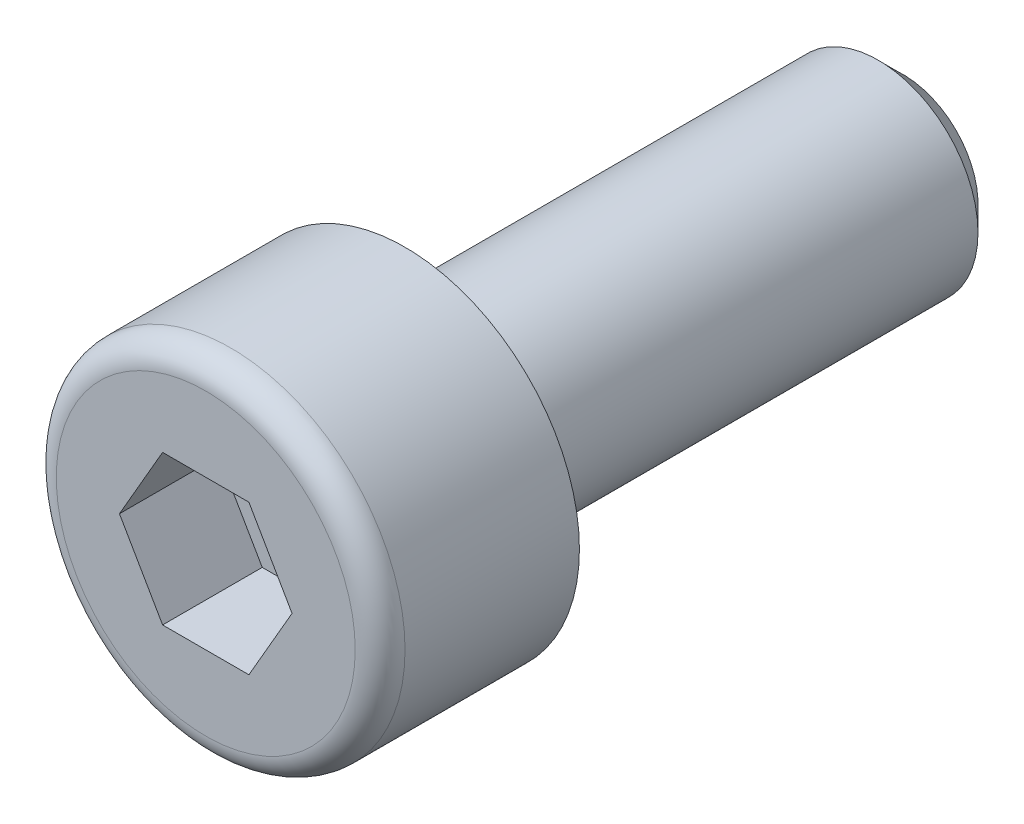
ISO-10303-21;
HEADER;
FILE_DESCRIPTION(('STEP AP214'),'2;1');
FILE_NAME('part.step','',(''),(''),'','','');
FILE_SCHEMA(('AUTOMOTIVE_DESIGN { 1 0 10303 214 1 1 1 1 }'));
ENDSEC;
DATA;
#1=APPLICATION_CONTEXT('core data for automotive mechanical design processes');
#2=APPLICATION_PROTOCOL_DEFINITION('international standard','automotive_design',2000,#1);
#3=PRODUCT_CONTEXT('',#1,'mechanical');
#4=PRODUCT('Part','Part','',(#3));
#5=PRODUCT_RELATED_PRODUCT_CATEGORY('part','',(#4));
#6=PRODUCT_DEFINITION_FORMATION('','',#4);
#7=PRODUCT_DEFINITION_CONTEXT('part definition',#1,'design');
#8=PRODUCT_DEFINITION('design','',#6,#7);
#9=PRODUCT_DEFINITION_SHAPE('','',#8);
#10=(LENGTH_UNIT() NAMED_UNIT(*) SI_UNIT(.MILLI.,.METRE.));
#11=(NAMED_UNIT(*) PLANE_ANGLE_UNIT() SI_UNIT($,.RADIAN.));
#12=(NAMED_UNIT(*) SI_UNIT($,.STERADIAN.) SOLID_ANGLE_UNIT());
#13=UNCERTAINTY_MEASURE_WITH_UNIT(LENGTH_MEASURE(1.E-05),#10,'distance_accuracy_value','');
#14=(GEOMETRIC_REPRESENTATION_CONTEXT(3) GLOBAL_UNCERTAINTY_ASSIGNED_CONTEXT((#13)) GLOBAL_UNIT_ASSIGNED_CONTEXT((#10,
#11,#12)) REPRESENTATION_CONTEXT('',''));
#15=CARTESIAN_POINT('',(0.,0.,0.));
#16=DIRECTION('',(0.,0.,1.));
#17=DIRECTION('',(1.,0.,0.));
#18=AXIS2_PLACEMENT_3D('',#15,#16,#17);
#19=CARTESIAN_POINT('',(0.,0.,0.));
#20=DIRECTION('',(0.,0.,1.));
#21=DIRECTION('',(1.,0.,0.));
#22=AXIS2_PLACEMENT_3D('',#19,#20,#21);
#23=PLANE('',#22);
#24=CARTESIAN_POINT('',(0.,0.,0.));
#25=DIRECTION('',(0.,0.,1.));
#26=DIRECTION('',(1.,0.,0.));
#27=AXIS2_PLACEMENT_3D('',#24,#25,#26);
#28=CIRCLE('',#27,3.5);
#29=CARTESIAN_POINT('',(3.5,0.,0.));
#30=VERTEX_POINT('',#29);
#31=EDGE_CURVE('E135',#30,#30,#28,.T.);
#32=ORIENTED_EDGE('',*,*,#31,.F.);
#33=EDGE_LOOP('',(#32));
#34=FACE_BOUND('',#33,.T.);
#35=CARTESIAN_POINT('',(0.,0.,0.));
#36=DIRECTION('',(0.,0.,1.));
#37=DIRECTION('',(1.,0.,0.));
#38=AXIS2_PLACEMENT_3D('',#35,#36,#37);
#39=CIRCLE('',#38,2.);
#40=CARTESIAN_POINT('',(2.,0.,0.));
#41=VERTEX_POINT('',#40);
#42=EDGE_CURVE('E144',#41,#41,#39,.F.);
#43=ORIENTED_EDGE('',*,*,#42,.F.);
#44=EDGE_LOOP('',(#43));
#45=FACE_BOUND('',#44,.T.);
#46=ADVANCED_FACE('F33',(#34,#45),#23,.F.);
#47=CARTESIAN_POINT('',(0.,0.,4.));
#48=DIRECTION('',(0.,0.,-1.));
#49=DIRECTION('',(-1.,0.,0.));
#50=AXIS2_PLACEMENT_3D('',#47,#48,#49);
#51=CYLINDRICAL_SURFACE('',#50,3.5);
#52=CARTESIAN_POINT('',(0.,0.,3.5));
#53=DIRECTION('',(0.,0.,1.));
#54=DIRECTION('',(1.,0.,0.));
#55=AXIS2_PLACEMENT_3D('',#52,#53,#54);
#56=CIRCLE('',#55,3.5);
#57=CARTESIAN_POINT('',(3.5,0.,3.5));
#58=VERTEX_POINT('',#57);
#59=EDGE_CURVE('E150',#58,#58,#56,.F.);
#60=ORIENTED_EDGE('',*,*,#59,.T.);
#61=EDGE_LOOP('',(#60));
#62=FACE_BOUND('',#61,.T.);
#63=ORIENTED_EDGE('',*,*,#31,.T.);
#64=EDGE_LOOP('',(#63));
#65=FACE_BOUND('',#64,.T.);
#66=ADVANCED_FACE('F35',(#62,#65),#51,.T.);
#67=CARTESIAN_POINT('',(0.,0.,4.));
#68=DIRECTION('',(0.,0.,1.));
#69=DIRECTION('',(1.,0.,0.));
#70=AXIS2_PLACEMENT_3D('',#67,#68,#69);
#71=PLANE('',#70);
#72=CARTESIAN_POINT('',(0.,0.,4.));
#73=DIRECTION('',(0.,0.,1.));
#74=DIRECTION('',(1.,0.,0.));
#75=AXIS2_PLACEMENT_3D('',#72,#73,#74);
#76=CIRCLE('',#75,3.);
#77=CARTESIAN_POINT('',(3.,0.,4.));
#78=VERTEX_POINT('',#77);
#79=EDGE_CURVE('E147',#78,#78,#76,.T.);
#80=ORIENTED_EDGE('',*,*,#79,.T.);
#81=EDGE_LOOP('',(#80));
#82=FACE_BOUND('',#81,.T.);
#83=DIRECTION('',(0.500000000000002,0.866025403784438,0.));
#84=VECTOR('',#83,1.);
#85=CARTESIAN_POINT('',(0.866025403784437,-1.5,4.));
#86=LINE('',#85,#84);
#87=CARTESIAN_POINT('',(0.866025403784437,-1.5,4.));
#88=VERTEX_POINT('',#87);
#89=CARTESIAN_POINT('',(1.73205080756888,0.,4.));
#90=VERTEX_POINT('',#89);
#91=EDGE_CURVE('E48',#88,#90,#86,.T.);
#92=ORIENTED_EDGE('',*,*,#91,.F.);
#93=DIRECTION('',(1.,0.,0.));
#94=VECTOR('',#93,1.);
#95=CARTESIAN_POINT('',(-0.866025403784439,-1.5,4.));
#96=LINE('',#95,#94);
#97=CARTESIAN_POINT('',(-0.866025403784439,-1.5,4.));
#98=VERTEX_POINT('',#97);
#99=EDGE_CURVE('E117',#98,#88,#96,.T.);
#100=ORIENTED_EDGE('',*,*,#99,.F.);
#101=DIRECTION('',(0.500000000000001,-0.866025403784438,0.));
#102=VECTOR('',#101,1.);
#103=CARTESIAN_POINT('',(-1.73205080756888,0.,4.));
#104=LINE('',#103,#102);
#105=CARTESIAN_POINT('',(-1.73205080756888,0.,4.));
#106=VERTEX_POINT('',#105);
#107=EDGE_CURVE('E111',#106,#98,#104,.T.);
#108=ORIENTED_EDGE('',*,*,#107,.F.);
#109=DIRECTION('',(-0.500000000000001,-0.866025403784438,0.));
#110=VECTOR('',#109,1.);
#111=CARTESIAN_POINT('',(-0.866025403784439,1.5,4.));
#112=LINE('',#111,#110);
#113=CARTESIAN_POINT('',(-0.866025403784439,1.5,4.));
#114=VERTEX_POINT('',#113);
#115=EDGE_CURVE('E109',#114,#106,#112,.T.);
#116=ORIENTED_EDGE('',*,*,#115,.F.);
#117=DIRECTION('',(-1.,0.,0.));
#118=VECTOR('',#117,1.);
#119=CARTESIAN_POINT('',(0.866025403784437,1.5,4.));
#120=LINE('',#119,#118);
#121=CARTESIAN_POINT('',(0.866025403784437,1.5,4.));
#122=VERTEX_POINT('',#121);
#123=EDGE_CURVE('E91',#122,#114,#120,.T.);
#124=ORIENTED_EDGE('',*,*,#123,.F.);
#125=DIRECTION('',(-0.500000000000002,0.866025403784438,0.));
#126=VECTOR('',#125,1.);
#127=CARTESIAN_POINT('',(1.73205080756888,0.,4.));
#128=LINE('',#127,#126);
#129=EDGE_CURVE('E102',#90,#122,#128,.T.);
#130=ORIENTED_EDGE('',*,*,#129,.F.);
#131=EDGE_LOOP('',(#92,#100,#108,#116,#124,#130));
#132=FACE_BOUND('',#131,.T.);
#133=ADVANCED_FACE('F106',(#82,#132),#71,.T.);
#134=CARTESIAN_POINT('',(0.,0.,-10.));
#135=DIRECTION('',(0.,0.,1.));
#136=DIRECTION('',(1.,0.,0.));
#137=AXIS2_PLACEMENT_3D('',#134,#135,#136);
#138=CYLINDRICAL_SURFACE('',#137,2.);
#139=CARTESIAN_POINT('',(0.,0.,-9.5));
#140=DIRECTION('',(0.,0.,-1.));
#141=DIRECTION('',(-1.,0.,0.));
#142=AXIS2_PLACEMENT_3D('',#139,#140,#141);
#143=CIRCLE('',#142,2.);
#144=CARTESIAN_POINT('',(-2.,0.,-9.5));
#145=VERTEX_POINT('',#144);
#146=EDGE_CURVE('E11',#145,#145,#143,.F.);
#147=ORIENTED_EDGE('',*,*,#146,.T.);
#148=EDGE_LOOP('',(#147));
#149=FACE_BOUND('',#148,.T.);
#150=ORIENTED_EDGE('',*,*,#42,.T.);
#151=EDGE_LOOP('',(#150));
#152=FACE_BOUND('',#151,.T.);
#153=ADVANCED_FACE('F179',(#149,#152),#138,.T.);
#154=CARTESIAN_POINT('',(0.,0.,-10.));
#155=DIRECTION('',(0.,0.,-1.));
#156=DIRECTION('',(-1.,0.,0.));
#157=AXIS2_PLACEMENT_3D('',#154,#155,#156);
#158=PLANE('',#157);
#159=CARTESIAN_POINT('',(0.,0.,-10.));
#160=DIRECTION('',(0.,0.,-1.));
#161=DIRECTION('',(-1.,0.,0.));
#162=AXIS2_PLACEMENT_3D('',#159,#160,#161);
#163=CIRCLE('',#162,1.49999999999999);
#164=CARTESIAN_POINT('',(-1.49999999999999,0.,-10.));
#165=VERTEX_POINT('',#164);
#166=EDGE_CURVE('E41',#165,#165,#163,.T.);
#167=ORIENTED_EDGE('',*,*,#166,.T.);
#168=EDGE_LOOP('',(#167));
#169=FACE_BOUND('',#168,.T.);
#170=ADVANCED_FACE('F155',(#169),#158,.T.);
#171=CARTESIAN_POINT('',(0.866025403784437,-1.5,2.));
#172=DIRECTION('',(0.866025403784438,-0.500000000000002,0.));
#173=DIRECTION('',(0.500000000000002,0.866025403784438,0.));
#174=AXIS2_PLACEMENT_3D('',#171,#172,#173);
#175=PLANE('',#174);
#176=ORIENTED_EDGE('',*,*,#91,.T.);
#177=DIRECTION('',(0.,0.,1.));
#178=VECTOR('',#177,1.);
#179=CARTESIAN_POINT('',(1.73205080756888,0.,2.));
#180=LINE('',#179,#178);
#181=CARTESIAN_POINT('',(1.73205080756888,0.,2.));
#182=VERTEX_POINT('',#181);
#183=EDGE_CURVE('E99',#182,#90,#180,.T.);
#184=ORIENTED_EDGE('',*,*,#183,.F.);
#185=DIRECTION('',(0.500000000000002,0.866025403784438,0.));
#186=VECTOR('',#185,1.);
#187=CARTESIAN_POINT('',(0.866025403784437,-1.5,2.));
#188=LINE('',#187,#186);
#189=CARTESIAN_POINT('',(0.866025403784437,-1.5,2.));
#190=VERTEX_POINT('',#189);
#191=EDGE_CURVE('E119',#190,#182,#188,.T.);
#192=ORIENTED_EDGE('',*,*,#191,.F.);
#193=DIRECTION('',(0.,0.,1.));
#194=VECTOR('',#193,1.);
#195=CARTESIAN_POINT('',(0.866025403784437,-1.5,2.));
#196=LINE('',#195,#194);
#197=EDGE_CURVE('E55',#190,#88,#196,.T.);
#198=ORIENTED_EDGE('',*,*,#197,.T.);
#199=EDGE_LOOP('',(#176,#184,#192,#198));
#200=FACE_BOUND('',#199,.T.);
#201=ADVANCED_FACE('F192',(#200),#175,.F.);
#202=CARTESIAN_POINT('',(-0.866025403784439,-1.5,2.));
#203=DIRECTION('',(0.,-1.,0.));
#204=DIRECTION('',(1.,0.,0.));
#205=AXIS2_PLACEMENT_3D('',#202,#203,#204);
#206=PLANE('',#205);
#207=ORIENTED_EDGE('',*,*,#99,.T.);
#208=ORIENTED_EDGE('',*,*,#197,.F.);
#209=DIRECTION('',(1.,0.,0.));
#210=VECTOR('',#209,1.);
#211=CARTESIAN_POINT('',(-0.866025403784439,-1.5,2.));
#212=LINE('',#211,#210);
#213=CARTESIAN_POINT('',(-0.866025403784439,-1.5,2.));
#214=VERTEX_POINT('',#213);
#215=EDGE_CURVE('E131',#214,#190,#212,.T.);
#216=ORIENTED_EDGE('',*,*,#215,.F.);
#217=DIRECTION('',(0.,0.,1.));
#218=VECTOR('',#217,1.);
#219=CARTESIAN_POINT('',(-0.866025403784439,-1.5,2.));
#220=LINE('',#219,#218);
#221=EDGE_CURVE('E136',#214,#98,#220,.T.);
#222=ORIENTED_EDGE('',*,*,#221,.T.);
#223=EDGE_LOOP('',(#207,#208,#216,#222));
#224=FACE_BOUND('',#223,.T.);
#225=ADVANCED_FACE('F198',(#224),#206,.F.);
#226=CARTESIAN_POINT('',(-1.73205080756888,0.,2.));
#227=DIRECTION('',(-0.866025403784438,-0.500000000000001,0.));
#228=DIRECTION('',(0.500000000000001,-0.866025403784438,0.));
#229=AXIS2_PLACEMENT_3D('',#226,#227,#228);
#230=PLANE('',#229);
#231=ORIENTED_EDGE('',*,*,#107,.T.);
#232=ORIENTED_EDGE('',*,*,#221,.F.);
#233=DIRECTION('',(0.500000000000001,-0.866025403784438,0.));
#234=VECTOR('',#233,1.);
#235=CARTESIAN_POINT('',(-1.73205080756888,0.,2.));
#236=LINE('',#235,#234);
#237=CARTESIAN_POINT('',(-1.73205080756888,0.,2.));
#238=VERTEX_POINT('',#237);
#239=EDGE_CURVE('E128',#238,#214,#236,.T.);
#240=ORIENTED_EDGE('',*,*,#239,.F.);
#241=DIRECTION('',(0.,0.,1.));
#242=VECTOR('',#241,1.);
#243=CARTESIAN_POINT('',(-1.73205080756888,0.,2.));
#244=LINE('',#243,#242);
#245=EDGE_CURVE('E138',#238,#106,#244,.T.);
#246=ORIENTED_EDGE('',*,*,#245,.T.);
#247=EDGE_LOOP('',(#231,#232,#240,#246));
#248=FACE_BOUND('',#247,.T.);
#249=ADVANCED_FACE('F208',(#248),#230,.F.);
#250=CARTESIAN_POINT('',(-0.866025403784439,1.5,2.));
#251=DIRECTION('',(-0.866025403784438,0.500000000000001,0.));
#252=DIRECTION('',(-0.500000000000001,-0.866025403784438,0.));
#253=AXIS2_PLACEMENT_3D('',#250,#251,#252);
#254=PLANE('',#253);
#255=ORIENTED_EDGE('',*,*,#115,.T.);
#256=ORIENTED_EDGE('',*,*,#245,.F.);
#257=DIRECTION('',(-0.500000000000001,-0.866025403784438,0.));
#258=VECTOR('',#257,1.);
#259=CARTESIAN_POINT('',(-0.866025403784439,1.5,2.));
#260=LINE('',#259,#258);
#261=CARTESIAN_POINT('',(-0.866025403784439,1.5,2.));
#262=VERTEX_POINT('',#261);
#263=EDGE_CURVE('E125',#262,#238,#260,.T.);
#264=ORIENTED_EDGE('',*,*,#263,.F.);
#265=DIRECTION('',(0.,0.,1.));
#266=VECTOR('',#265,1.);
#267=CARTESIAN_POINT('',(-0.866025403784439,1.5,2.));
#268=LINE('',#267,#266);
#269=EDGE_CURVE('E98',#262,#114,#268,.T.);
#270=ORIENTED_EDGE('',*,*,#269,.T.);
#271=EDGE_LOOP('',(#255,#256,#264,#270));
#272=FACE_BOUND('',#271,.T.);
#273=ADVANCED_FACE('F205',(#272),#254,.F.);
#274=CARTESIAN_POINT('',(0.866025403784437,1.5,2.));
#275=DIRECTION('',(0.,1.,0.));
#276=DIRECTION('',(-1.,0.,0.));
#277=AXIS2_PLACEMENT_3D('',#274,#275,#276);
#278=PLANE('',#277);
#279=ORIENTED_EDGE('',*,*,#123,.T.);
#280=ORIENTED_EDGE('',*,*,#269,.F.);
#281=DIRECTION('',(-1.,0.,0.));
#282=VECTOR('',#281,1.);
#283=CARTESIAN_POINT('',(0.866025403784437,1.5,2.));
#284=LINE('',#283,#282);
#285=CARTESIAN_POINT('',(0.866025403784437,1.5,2.));
#286=VERTEX_POINT('',#285);
#287=EDGE_CURVE('E94',#286,#262,#284,.T.);
#288=ORIENTED_EDGE('',*,*,#287,.F.);
#289=DIRECTION('',(0.,0.,1.));
#290=VECTOR('',#289,1.);
#291=CARTESIAN_POINT('',(0.866025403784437,1.5,2.));
#292=LINE('',#291,#290);
#293=EDGE_CURVE('E87',#286,#122,#292,.T.);
#294=ORIENTED_EDGE('',*,*,#293,.T.);
#295=EDGE_LOOP('',(#279,#280,#288,#294));
#296=FACE_BOUND('',#295,.T.);
#297=ADVANCED_FACE('F89',(#296),#278,.F.);
#298=CARTESIAN_POINT('',(1.73205080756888,0.,2.));
#299=DIRECTION('',(0.866025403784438,0.500000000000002,0.));
#300=DIRECTION('',(-0.500000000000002,0.866025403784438,0.));
#301=AXIS2_PLACEMENT_3D('',#298,#299,#300);
#302=PLANE('',#301);
#303=ORIENTED_EDGE('',*,*,#129,.T.);
#304=ORIENTED_EDGE('',*,*,#293,.F.);
#305=DIRECTION('',(-0.500000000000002,0.866025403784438,0.));
#306=VECTOR('',#305,1.);
#307=CARTESIAN_POINT('',(1.73205080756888,0.,2.));
#308=LINE('',#307,#306);
#309=EDGE_CURVE('E122',#182,#286,#308,.T.);
#310=ORIENTED_EDGE('',*,*,#309,.F.);
#311=ORIENTED_EDGE('',*,*,#183,.T.);
#312=EDGE_LOOP('',(#303,#304,#310,#311));
#313=FACE_BOUND('',#312,.T.);
#314=ADVANCED_FACE('F103',(#313),#302,.F.);
#315=CARTESIAN_POINT('',(1.73205080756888,0.,2.));
#316=DIRECTION('',(0.,0.,1.));
#317=DIRECTION('',(1.,0.,0.));
#318=AXIS2_PLACEMENT_3D('',#315,#316,#317);
#319=PLANE('',#318);
#320=ORIENTED_EDGE('',*,*,#191,.T.);
#321=ORIENTED_EDGE('',*,*,#309,.T.);
#322=ORIENTED_EDGE('',*,*,#287,.T.);
#323=ORIENTED_EDGE('',*,*,#263,.T.);
#324=ORIENTED_EDGE('',*,*,#239,.T.);
#325=ORIENTED_EDGE('',*,*,#215,.T.);
#326=EDGE_LOOP('',(#320,#321,#322,#323,#324,#325));
#327=FACE_BOUND('',#326,.T.);
#328=ADVANCED_FACE('F165',(#327),#319,.T.);
#329=CARTESIAN_POINT('',(0.,0.,3.5));
#330=DIRECTION('',(0.,0.,1.));
#331=DIRECTION('',(1.,0.,0.));
#332=AXIS2_PLACEMENT_3D('',#329,#330,#331);
#333=TOROIDAL_SURFACE('',#332,3.,0.5);
#334=ORIENTED_EDGE('',*,*,#59,.F.);
#335=EDGE_LOOP('',(#334));
#336=FACE_BOUND('',#335,.T.);
#337=ORIENTED_EDGE('',*,*,#79,.F.);
#338=EDGE_LOOP('',(#337));
#339=FACE_BOUND('',#338,.T.);
#340=ADVANCED_FACE('F159',(#336,#339),#333,.T.);
#341=CARTESIAN_POINT('',(0.,0.,-10.));
#342=DIRECTION('',(0.,0.,1.));
#343=DIRECTION('',(1.,0.,0.));
#344=AXIS2_PLACEMENT_3D('',#341,#342,#343);
#345=CONICAL_SURFACE('',#344,1.49999999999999,0.785398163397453);
#346=ORIENTED_EDGE('',*,*,#146,.F.);
#347=EDGE_LOOP('',(#346));
#348=FACE_BOUND('',#347,.T.);
#349=ORIENTED_EDGE('',*,*,#166,.F.);
#350=EDGE_LOOP('',(#349));
#351=FACE_BOUND('',#350,.T.);
#352=ADVANCED_FACE('F157',(#348,#351),#345,.T.);
#353=CLOSED_SHELL('',(#46,#66,#133,#153,#170,#201,#225,#249,#273,#297,#314,#328,#340,#352));
#354=MANIFOLD_SOLID_BREP('B2',#353);
#355=ADVANCED_BREP_SHAPE_REPRESENTATION('',(#18,#354),#14);
#356=SHAPE_DEFINITION_REPRESENTATION(#9,#355);
ENDSEC;
END-ISO-10303-21;
